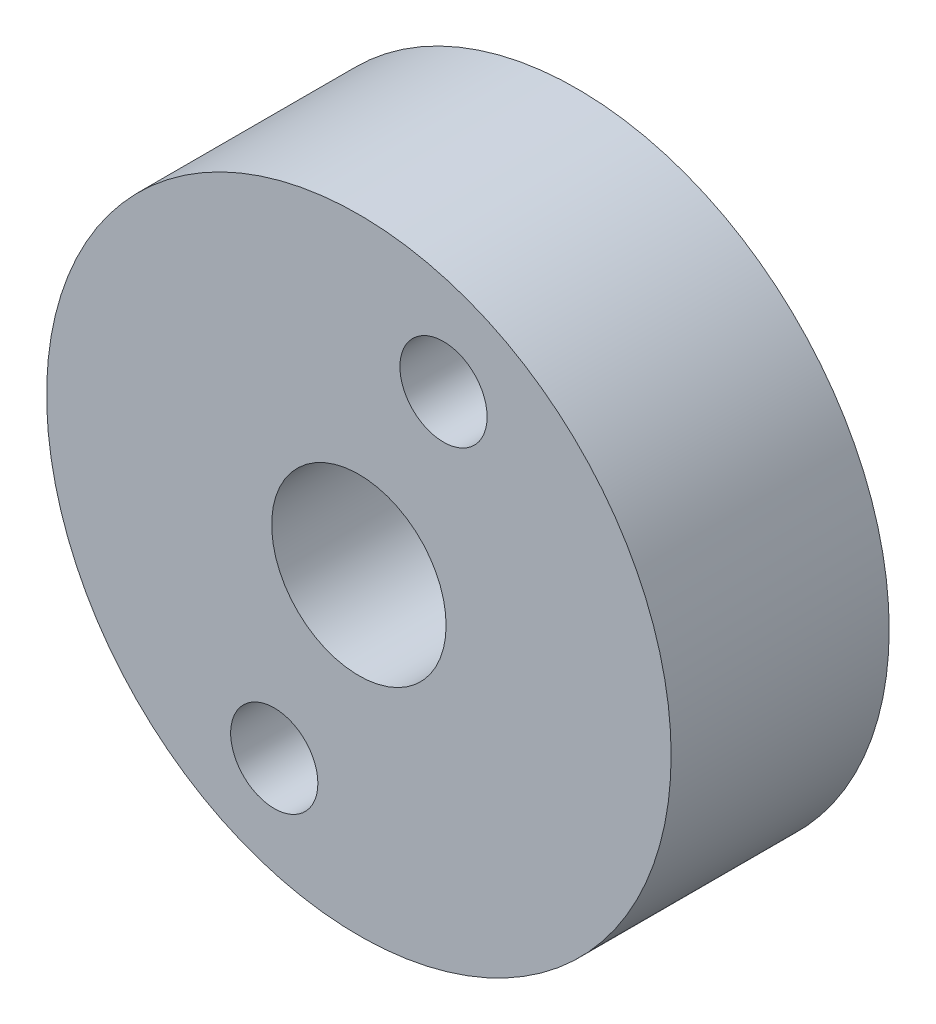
from build123d import *

# Parameters (mm, degrees)
SKETCH1_R           = 7.16
BOSS_EXTRUDE1_DEPTH = 5
SKETCH2_R           = 2
SKETCH2_R_2         = 1
CUT_EXTRUDE1_DEPTH  = 5


with BuildPart() as part:
    # Sketch1 → Boss-Extrude1 (new body)
    with BuildSketch(Plane.XY):
        Circle(SKETCH1_R)
    extrude(amount=BOSS_EXTRUDE1_DEPTH)

    # Sketch2 → Cut-Extrude1 (cut)
    with BuildSketch(Plane.XY.offset(5)):
        Circle(SKETCH2_R)
        with Locations((1.940417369, 4.608121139)):
            Circle(SKETCH2_R_2)
        with Locations((-1.940417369, -4.608121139)):
            Circle(SKETCH2_R_2)
    extrude(amount=-CUT_EXTRUDE1_DEPTH, mode=Mode.SUBTRACT)


solid = part.part
